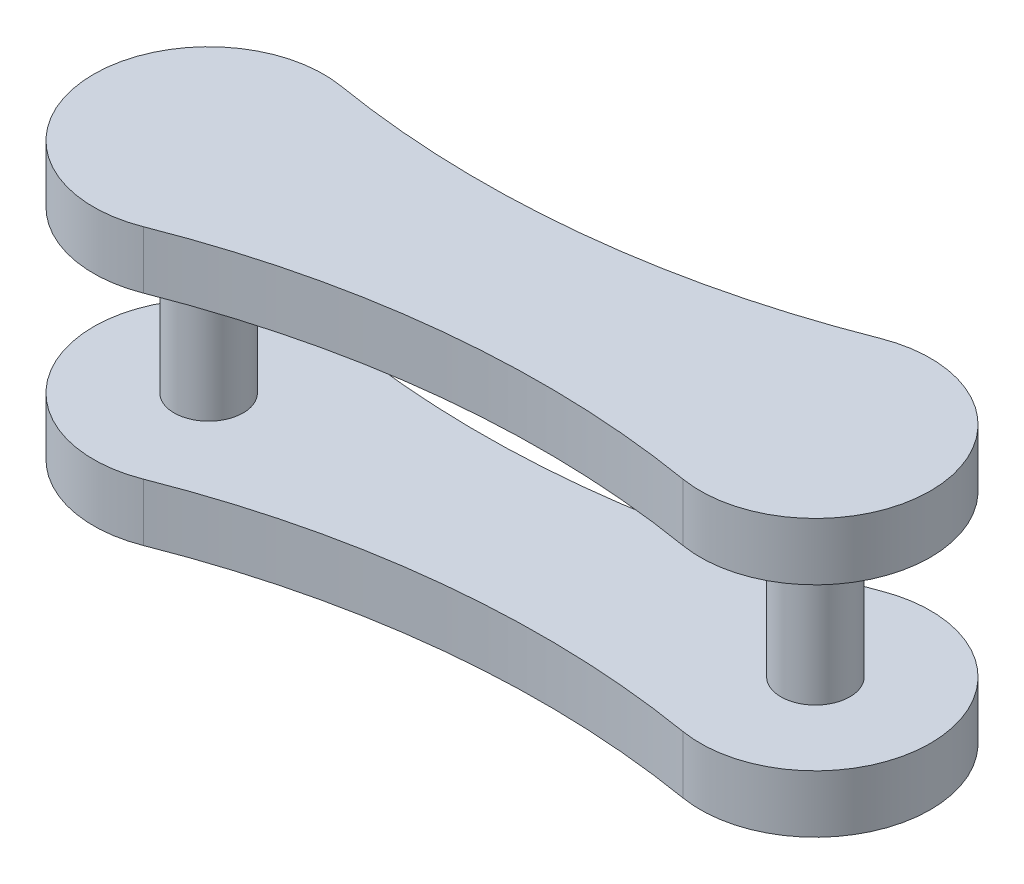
ISO-10303-21;
HEADER;
FILE_DESCRIPTION(('STEP AP214'),'2;1');
FILE_NAME('part.step','',(''),(''),'','','');
FILE_SCHEMA(('AUTOMOTIVE_DESIGN { 1 0 10303 214 1 1 1 1 }'));
ENDSEC;
DATA;
#1=APPLICATION_CONTEXT('core data for automotive mechanical design processes');
#2=APPLICATION_PROTOCOL_DEFINITION('international standard','automotive_design',2000,#1);
#3=PRODUCT_CONTEXT('',#1,'mechanical');
#4=PRODUCT('Part','Part','',(#3));
#5=PRODUCT_RELATED_PRODUCT_CATEGORY('part','',(#4));
#6=PRODUCT_DEFINITION_FORMATION('','',#4);
#7=PRODUCT_DEFINITION_CONTEXT('part definition',#1,'design');
#8=PRODUCT_DEFINITION('design','',#6,#7);
#9=PRODUCT_DEFINITION_SHAPE('','',#8);
#10=(LENGTH_UNIT() NAMED_UNIT(*) SI_UNIT(.MILLI.,.METRE.));
#11=(NAMED_UNIT(*) PLANE_ANGLE_UNIT() SI_UNIT($,.RADIAN.));
#12=(NAMED_UNIT(*) SI_UNIT($,.STERADIAN.) SOLID_ANGLE_UNIT());
#13=UNCERTAINTY_MEASURE_WITH_UNIT(LENGTH_MEASURE(1.E-05),#10,'distance_accuracy_value','');
#14=(GEOMETRIC_REPRESENTATION_CONTEXT(3) GLOBAL_UNCERTAINTY_ASSIGNED_CONTEXT((#13)) GLOBAL_UNIT_ASSIGNED_CONTEXT((#10,
#11,#12)) REPRESENTATION_CONTEXT('',''));
#15=CARTESIAN_POINT('',(0.,0.,0.));
#16=DIRECTION('',(0.,0.,1.));
#17=DIRECTION('',(1.,0.,0.));
#18=AXIS2_PLACEMENT_3D('',#15,#16,#17);
#19=CARTESIAN_POINT('',(0.,6.,0.));
#20=DIRECTION('',(0.,-1.,0.));
#21=DIRECTION('',(0.,0.,-1.));
#22=AXIS2_PLACEMENT_3D('',#19,#20,#21);
#23=PLANE('',#22);
#24=CARTESIAN_POINT('',(0.,6.,0.));
#25=DIRECTION('',(0.,-1.,0.));
#26=DIRECTION('',(0.994559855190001,0.,-0.104166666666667));
#27=AXIS2_PLACEMENT_3D('',#24,#25,#26);
#28=CIRCLE('',#27,5.);
#29=CARTESIAN_POINT('',(1.8280531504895,6.,4.65383945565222));
#30=VERTEX_POINT('',#29);
#31=CARTESIAN_POINT('',(0.824106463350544,6.,-4.93161723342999));
#32=VERTEX_POINT('',#31);
#33=EDGE_CURVE('E102',#30,#32,#28,.T.);
#34=ORIENTED_EDGE('',*,*,#33,.F.);
#35=CARTESIAN_POINT('',(16.4524783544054,6.,41.8845551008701));
#36=DIRECTION('',(0.,-1.,0.));
#37=DIRECTION('',(0.994559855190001,0.,-0.104166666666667));
#38=AXIS2_PLACEMENT_3D('',#35,#36,#37);
#39=CIRCLE('',#38,40.);
#40=CARTESIAN_POINT('',(23.0453300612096,6.,2.43161723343));
#41=VERTEX_POINT('',#40);
#42=EDGE_CURVE('E173',#30,#41,#39,.T.);
#43=ORIENTED_EDGE('',*,*,#42,.T.);
#44=CARTESIAN_POINT('',(23.86943652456,6.,-2.5));
#45=DIRECTION('',(0.,-1.,0.));
#46=DIRECTION('',(-0.994559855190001,0.,0.104166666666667));
#47=AXIS2_PLACEMENT_3D('',#44,#45,#46);
#48=CIRCLE('',#47,5.);
#49=CARTESIAN_POINT('',(22.0413833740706,6.,-7.15383945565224));
#50=VERTEX_POINT('',#49);
#51=EDGE_CURVE('E33',#50,#41,#48,.T.);
#52=ORIENTED_EDGE('',*,*,#51,.F.);
#53=CARTESIAN_POINT('',(7.4169581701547,6.,-44.3845551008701));
#54=DIRECTION('',(0.,-1.,0.));
#55=DIRECTION('',(-0.994559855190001,0.,0.104166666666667));
#56=AXIS2_PLACEMENT_3D('',#53,#54,#55);
#57=CIRCLE('',#56,40.);
#58=EDGE_CURVE('E110',#50,#32,#57,.T.);
#59=ORIENTED_EDGE('',*,*,#58,.T.);
#60=EDGE_LOOP('',(#34,#43,#52,#59));
#61=FACE_BOUND('',#60,.T.);
#62=ADVANCED_FACE('F14',(#61),#23,.F.);
#63=CARTESIAN_POINT('',(0.,-6.,0.));
#64=DIRECTION('',(0.,-1.,0.));
#65=DIRECTION('',(0.,0.,-1.));
#66=AXIS2_PLACEMENT_3D('',#63,#64,#65);
#67=PLANE('',#66);
#68=CARTESIAN_POINT('',(16.4524783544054,-6.,41.8845551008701));
#69=DIRECTION('',(0.,-1.,0.));
#70=DIRECTION('',(0.994559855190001,0.,-0.104166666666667));
#71=AXIS2_PLACEMENT_3D('',#68,#69,#70);
#72=CIRCLE('',#71,40.);
#73=CARTESIAN_POINT('',(1.8280531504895,-6.,4.65383945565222));
#74=VERTEX_POINT('',#73);
#75=CARTESIAN_POINT('',(23.0453300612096,-6.,2.43161723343));
#76=VERTEX_POINT('',#75);
#77=EDGE_CURVE('E129',#74,#76,#72,.T.);
#78=ORIENTED_EDGE('',*,*,#77,.F.);
#79=CARTESIAN_POINT('',(0.,-6.,0.));
#80=DIRECTION('',(0.,-1.,0.));
#81=DIRECTION('',(0.994559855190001,0.,-0.104166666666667));
#82=AXIS2_PLACEMENT_3D('',#79,#80,#81);
#83=CIRCLE('',#82,5.);
#84=CARTESIAN_POINT('',(0.824106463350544,-6.,-4.93161723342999));
#85=VERTEX_POINT('',#84);
#86=EDGE_CURVE('E150',#74,#85,#83,.T.);
#87=ORIENTED_EDGE('',*,*,#86,.T.);
#88=CARTESIAN_POINT('',(7.4169581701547,-6.,-44.3845551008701));
#89=DIRECTION('',(0.,-1.,0.));
#90=DIRECTION('',(-0.994559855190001,0.,0.104166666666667));
#91=AXIS2_PLACEMENT_3D('',#88,#89,#90);
#92=CIRCLE('',#91,40.);
#93=CARTESIAN_POINT('',(22.0413833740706,-6.,-7.15383945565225));
#94=VERTEX_POINT('',#93);
#95=EDGE_CURVE('E134',#94,#85,#92,.T.);
#96=ORIENTED_EDGE('',*,*,#95,.F.);
#97=CARTESIAN_POINT('',(23.86943652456,-6.,-2.5));
#98=DIRECTION('',(0.,-1.,0.));
#99=DIRECTION('',(-0.994559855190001,0.,0.104166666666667));
#100=AXIS2_PLACEMENT_3D('',#97,#98,#99);
#101=CIRCLE('',#100,5.);
#102=EDGE_CURVE('E152',#94,#76,#101,.T.);
#103=ORIENTED_EDGE('',*,*,#102,.T.);
#104=EDGE_LOOP('',(#78,#87,#96,#103));
#105=FACE_BOUND('',#104,.T.);
#106=ADVANCED_FACE('F217',(#105),#67,.T.);
#107=CARTESIAN_POINT('',(0.,-6.,0.));
#108=DIRECTION('',(0.,1.,0.));
#109=DIRECTION('',(0.,0.,1.));
#110=AXIS2_PLACEMENT_3D('',#107,#108,#109);
#111=CYLINDRICAL_SURFACE('',#110,1.5);
#112=CARTESIAN_POINT('',(0.,3.5,0.));
#113=DIRECTION('',(0.,-1.,0.));
#114=DIRECTION('',(1.,0.,0.));
#115=AXIS2_PLACEMENT_3D('',#112,#113,#114);
#116=CIRCLE('',#115,1.5);
#117=CARTESIAN_POINT('',(1.5,3.5,0.));
#118=VERTEX_POINT('',#117);
#119=EDGE_CURVE('E9',#118,#118,#116,.T.);
#120=ORIENTED_EDGE('',*,*,#119,.T.);
#121=EDGE_LOOP('',(#120));
#122=FACE_BOUND('',#121,.T.);
#123=CARTESIAN_POINT('',(0.,-3.5,0.));
#124=DIRECTION('',(0.,-1.,0.));
#125=DIRECTION('',(1.,0.,0.));
#126=AXIS2_PLACEMENT_3D('',#123,#124,#125);
#127=CIRCLE('',#126,1.5);
#128=CARTESIAN_POINT('',(1.5,-3.5,0.));
#129=VERTEX_POINT('',#128);
#130=EDGE_CURVE('E24',#129,#129,#127,.T.);
#131=ORIENTED_EDGE('',*,*,#130,.F.);
#132=EDGE_LOOP('',(#131));
#133=FACE_BOUND('',#132,.T.);
#134=ADVANCED_FACE('F210',(#122,#133),#111,.T.);
#135=CARTESIAN_POINT('',(23.86943652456,-6.,-2.49999999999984));
#136=DIRECTION('',(0.,1.,0.));
#137=DIRECTION('',(0.445861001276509,0.,-0.895102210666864));
#138=AXIS2_PLACEMENT_3D('',#135,#136,#137);
#139=CYLINDRICAL_SURFACE('',#138,1.5);
#140=CARTESIAN_POINT('',(23.86943652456,3.5,-2.5));
#141=DIRECTION('',(0.,-1.,0.));
#142=DIRECTION('',(0.994559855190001,0.,-0.104166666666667));
#143=AXIS2_PLACEMENT_3D('',#140,#141,#142);
#144=CIRCLE('',#143,1.5);
#145=CARTESIAN_POINT('',(25.3612763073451,3.5,-2.65625));
#146=VERTEX_POINT('',#145);
#147=EDGE_CURVE('E119',#146,#146,#144,.T.);
#148=ORIENTED_EDGE('',*,*,#147,.T.);
#149=EDGE_LOOP('',(#148));
#150=FACE_BOUND('',#149,.T.);
#151=CARTESIAN_POINT('',(23.86943652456,-3.5,-2.5));
#152=DIRECTION('',(0.,-1.,0.));
#153=DIRECTION('',(0.994559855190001,0.,-0.104166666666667));
#154=AXIS2_PLACEMENT_3D('',#151,#152,#153);
#155=CIRCLE('',#154,1.5);
#156=CARTESIAN_POINT('',(25.3612763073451,-3.5,-2.65625));
#157=VERTEX_POINT('',#156);
#158=EDGE_CURVE('E121',#157,#157,#155,.T.);
#159=ORIENTED_EDGE('',*,*,#158,.F.);
#160=EDGE_LOOP('',(#159));
#161=FACE_BOUND('',#160,.T.);
#162=ADVANCED_FACE('F195',(#150,#161),#139,.T.);
#163=CARTESIAN_POINT('',(23.86943652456,-6.,-2.5));
#164=DIRECTION('',(0.,1.,0.));
#165=DIRECTION('',(-0.994559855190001,0.,0.104166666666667));
#166=AXIS2_PLACEMENT_3D('',#163,#164,#165);
#167=CYLINDRICAL_SURFACE('',#166,5.);
#168=CARTESIAN_POINT('',(23.86943652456,-3.5,-2.5));
#169=DIRECTION('',(0.,-1.,0.));
#170=DIRECTION('',(-0.994559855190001,0.,0.104166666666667));
#171=AXIS2_PLACEMENT_3D('',#168,#169,#170);
#172=CIRCLE('',#171,5.);
#173=CARTESIAN_POINT('',(22.0413833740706,-3.5,-7.15383945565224));
#174=VERTEX_POINT('',#173);
#175=CARTESIAN_POINT('',(23.0453300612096,-3.5,2.43161723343));
#176=VERTEX_POINT('',#175);
#177=EDGE_CURVE('E18',#174,#176,#172,.T.);
#178=ORIENTED_EDGE('',*,*,#177,.T.);
#179=DIRECTION('',(0.,-1.,0.));
#180=VECTOR('',#179,1.);
#181=CARTESIAN_POINT('',(23.0453300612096,-3.5,2.43161723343));
#182=LINE('',#181,#180);
#183=EDGE_CURVE('E132',#176,#76,#182,.T.);
#184=ORIENTED_EDGE('',*,*,#183,.T.);
#185=ORIENTED_EDGE('',*,*,#102,.F.);
#186=DIRECTION('',(0.,-1.,0.));
#187=VECTOR('',#186,1.);
#188=CARTESIAN_POINT('',(22.0413833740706,-3.5,-7.15383945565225));
#189=LINE('',#188,#187);
#190=EDGE_CURVE('E139',#174,#94,#189,.T.);
#191=ORIENTED_EDGE('',*,*,#190,.F.);
#192=EDGE_LOOP('',(#178,#184,#185,#191));
#193=FACE_BOUND('',#192,.T.);
#194=ADVANCED_FACE('F165',(#193),#167,.T.);
#195=CARTESIAN_POINT('',(7.4169581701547,-3.5,-44.3845551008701));
#196=DIRECTION('',(0.,-1.,0.));
#197=DIRECTION('',(0.994559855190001,0.,-0.104166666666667));
#198=AXIS2_PLACEMENT_3D('',#195,#196,#197);
#199=CYLINDRICAL_SURFACE('',#198,40.);
#200=ORIENTED_EDGE('',*,*,#95,.T.);
#201=DIRECTION('',(0.,-1.,0.));
#202=VECTOR('',#201,1.);
#203=CARTESIAN_POINT('',(0.824106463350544,-3.5,-4.93161723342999));
#204=LINE('',#203,#202);
#205=CARTESIAN_POINT('',(0.824106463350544,-3.5,-4.93161723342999));
#206=VERTEX_POINT('',#205);
#207=EDGE_CURVE('E142',#206,#85,#204,.T.);
#208=ORIENTED_EDGE('',*,*,#207,.F.);
#209=CARTESIAN_POINT('',(7.4169581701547,-3.5,-44.3845551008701));
#210=DIRECTION('',(0.,-1.,0.));
#211=DIRECTION('',(-0.994559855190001,0.,0.104166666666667));
#212=AXIS2_PLACEMENT_3D('',#209,#210,#211);
#213=CIRCLE('',#212,40.);
#214=EDGE_CURVE('E137',#174,#206,#213,.T.);
#215=ORIENTED_EDGE('',*,*,#214,.F.);
#216=ORIENTED_EDGE('',*,*,#190,.T.);
#217=EDGE_LOOP('',(#200,#208,#215,#216));
#218=FACE_BOUND('',#217,.T.);
#219=ADVANCED_FACE('F158',(#218),#199,.F.);
#220=CARTESIAN_POINT('',(0.,-6.,0.));
#221=DIRECTION('',(0.,1.,0.));
#222=DIRECTION('',(-0.994559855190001,0.,0.104166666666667));
#223=AXIS2_PLACEMENT_3D('',#220,#221,#222);
#224=CYLINDRICAL_SURFACE('',#223,5.);
#225=CARTESIAN_POINT('',(0.,-3.5,0.));
#226=DIRECTION('',(0.,-1.,0.));
#227=DIRECTION('',(0.994559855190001,0.,-0.104166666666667));
#228=AXIS2_PLACEMENT_3D('',#225,#226,#227);
#229=CIRCLE('',#228,5.);
#230=CARTESIAN_POINT('',(1.8280531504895,-3.5,4.65383945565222));
#231=VERTEX_POINT('',#230);
#232=EDGE_CURVE('E145',#231,#206,#229,.T.);
#233=ORIENTED_EDGE('',*,*,#232,.T.);
#234=ORIENTED_EDGE('',*,*,#207,.T.);
#235=ORIENTED_EDGE('',*,*,#86,.F.);
#236=DIRECTION('',(0.,-1.,0.));
#237=VECTOR('',#236,1.);
#238=CARTESIAN_POINT('',(1.8280531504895,-3.5,4.65383945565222));
#239=LINE('',#238,#237);
#240=EDGE_CURVE('E128',#231,#74,#239,.T.);
#241=ORIENTED_EDGE('',*,*,#240,.F.);
#242=EDGE_LOOP('',(#233,#234,#235,#241));
#243=FACE_BOUND('',#242,.T.);
#244=ADVANCED_FACE('F16',(#243),#224,.T.);
#245=CARTESIAN_POINT('',(16.4524783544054,-3.5,41.8845551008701));
#246=DIRECTION('',(0.,-1.,0.));
#247=DIRECTION('',(0.994559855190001,0.,-0.104166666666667));
#248=AXIS2_PLACEMENT_3D('',#245,#246,#247);
#249=CYLINDRICAL_SURFACE('',#248,40.);
#250=ORIENTED_EDGE('',*,*,#77,.T.);
#251=ORIENTED_EDGE('',*,*,#183,.F.);
#252=CARTESIAN_POINT('',(16.4524783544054,-3.5,41.8845551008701));
#253=DIRECTION('',(0.,-1.,0.));
#254=DIRECTION('',(0.994559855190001,0.,-0.104166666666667));
#255=AXIS2_PLACEMENT_3D('',#252,#253,#254);
#256=CIRCLE('',#255,40.);
#257=EDGE_CURVE('E126',#231,#176,#256,.T.);
#258=ORIENTED_EDGE('',*,*,#257,.F.);
#259=ORIENTED_EDGE('',*,*,#240,.T.);
#260=EDGE_LOOP('',(#250,#251,#258,#259));
#261=FACE_BOUND('',#260,.T.);
#262=ADVANCED_FACE('F163',(#261),#249,.F.);
#263=CARTESIAN_POINT('',(0.,-3.5,0.));
#264=DIRECTION('',(0.,-1.,0.));
#265=DIRECTION('',(0.994559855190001,0.,-0.104166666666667));
#266=AXIS2_PLACEMENT_3D('',#263,#264,#265);
#267=PLANE('',#266);
#268=ORIENTED_EDGE('',*,*,#232,.F.);
#269=ORIENTED_EDGE('',*,*,#257,.T.);
#270=ORIENTED_EDGE('',*,*,#177,.F.);
#271=ORIENTED_EDGE('',*,*,#214,.T.);
#272=EDGE_LOOP('',(#268,#269,#270,#271));
#273=FACE_BOUND('',#272,.T.);
#274=ORIENTED_EDGE('',*,*,#158,.T.);
#275=EDGE_LOOP('',(#274));
#276=FACE_BOUND('',#275,.T.);
#277=ORIENTED_EDGE('',*,*,#130,.T.);
#278=EDGE_LOOP('',(#277));
#279=FACE_BOUND('',#278,.T.);
#280=ADVANCED_FACE('F160',(#273,#276,#279),#267,.F.);
#281=CARTESIAN_POINT('',(7.4169581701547,6.,-44.3845551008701));
#282=DIRECTION('',(0.,-1.,0.));
#283=DIRECTION('',(0.994559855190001,0.,-0.104166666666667));
#284=AXIS2_PLACEMENT_3D('',#281,#282,#283);
#285=CYLINDRICAL_SURFACE('',#284,40.);
#286=CARTESIAN_POINT('',(7.4169581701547,3.5,-44.3845551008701));
#287=DIRECTION('',(0.,-1.,0.));
#288=DIRECTION('',(-0.994559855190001,0.,0.104166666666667));
#289=AXIS2_PLACEMENT_3D('',#286,#287,#288);
#290=CIRCLE('',#289,40.);
#291=CARTESIAN_POINT('',(22.0413833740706,3.5,-7.15383945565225));
#292=VERTEX_POINT('',#291);
#293=CARTESIAN_POINT('',(0.824106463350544,3.5,-4.93161723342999));
#294=VERTEX_POINT('',#293);
#295=EDGE_CURVE('E93',#292,#294,#290,.T.);
#296=ORIENTED_EDGE('',*,*,#295,.T.);
#297=DIRECTION('',(0.,-1.,0.));
#298=VECTOR('',#297,1.);
#299=CARTESIAN_POINT('',(0.824106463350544,6.,-4.93161723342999));
#300=LINE('',#299,#298);
#301=EDGE_CURVE('E99',#32,#294,#300,.T.);
#302=ORIENTED_EDGE('',*,*,#301,.F.);
#303=ORIENTED_EDGE('',*,*,#58,.F.);
#304=DIRECTION('',(0.,-1.,0.));
#305=VECTOR('',#304,1.);
#306=CARTESIAN_POINT('',(22.0413833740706,6.,-7.15383945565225));
#307=LINE('',#306,#305);
#308=EDGE_CURVE('E106',#50,#292,#307,.T.);
#309=ORIENTED_EDGE('',*,*,#308,.T.);
#310=EDGE_LOOP('',(#296,#302,#303,#309));
#311=FACE_BOUND('',#310,.T.);
#312=ADVANCED_FACE('F109',(#311),#285,.F.);
#313=CARTESIAN_POINT('',(23.86943652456,3.5,-2.5));
#314=DIRECTION('',(0.,1.,0.));
#315=DIRECTION('',(-0.994559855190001,0.,0.104166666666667));
#316=AXIS2_PLACEMENT_3D('',#313,#314,#315);
#317=CYLINDRICAL_SURFACE('',#316,5.);
#318=ORIENTED_EDGE('',*,*,#51,.T.);
#319=DIRECTION('',(0.,-1.,0.));
#320=VECTOR('',#319,1.);
#321=CARTESIAN_POINT('',(23.0453300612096,6.,2.43161723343));
#322=LINE('',#321,#320);
#323=CARTESIAN_POINT('',(23.0453300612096,3.5,2.43161723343));
#324=VERTEX_POINT('',#323);
#325=EDGE_CURVE('E111',#41,#324,#322,.T.);
#326=ORIENTED_EDGE('',*,*,#325,.T.);
#327=CARTESIAN_POINT('',(23.86943652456,3.5,-2.5));
#328=DIRECTION('',(0.,-1.,0.));
#329=DIRECTION('',(-0.994559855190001,0.,0.104166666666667));
#330=AXIS2_PLACEMENT_3D('',#327,#328,#329);
#331=CIRCLE('',#330,5.);
#332=EDGE_CURVE('E96',#292,#324,#331,.T.);
#333=ORIENTED_EDGE('',*,*,#332,.F.);
#334=ORIENTED_EDGE('',*,*,#308,.F.);
#335=EDGE_LOOP('',(#318,#326,#333,#334));
#336=FACE_BOUND('',#335,.T.);
#337=ADVANCED_FACE('F180',(#336),#317,.T.);
#338=CARTESIAN_POINT('',(16.4524783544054,6.,41.8845551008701));
#339=DIRECTION('',(0.,-1.,0.));
#340=DIRECTION('',(0.994559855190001,0.,-0.104166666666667));
#341=AXIS2_PLACEMENT_3D('',#338,#339,#340);
#342=CYLINDRICAL_SURFACE('',#341,40.);
#343=CARTESIAN_POINT('',(16.4524783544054,3.5,41.8845551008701));
#344=DIRECTION('',(0.,-1.,0.));
#345=DIRECTION('',(0.994559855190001,0.,-0.104166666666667));
#346=AXIS2_PLACEMENT_3D('',#343,#344,#345);
#347=CIRCLE('',#346,40.);
#348=CARTESIAN_POINT('',(1.8280531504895,3.5,4.65383945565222));
#349=VERTEX_POINT('',#348);
#350=EDGE_CURVE('E95',#349,#324,#347,.T.);
#351=ORIENTED_EDGE('',*,*,#350,.T.);
#352=ORIENTED_EDGE('',*,*,#325,.F.);
#353=ORIENTED_EDGE('',*,*,#42,.F.);
#354=DIRECTION('',(0.,-1.,0.));
#355=VECTOR('',#354,1.);
#356=CARTESIAN_POINT('',(1.8280531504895,6.,4.65383945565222));
#357=LINE('',#356,#355);
#358=EDGE_CURVE('E114',#30,#349,#357,.T.);
#359=ORIENTED_EDGE('',*,*,#358,.T.);
#360=EDGE_LOOP('',(#351,#352,#353,#359));
#361=FACE_BOUND('',#360,.T.);
#362=ADVANCED_FACE('F178',(#361),#342,.F.);
#363=CARTESIAN_POINT('',(0.,3.5,0.));
#364=DIRECTION('',(0.,1.,0.));
#365=DIRECTION('',(-0.994559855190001,0.,0.104166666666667));
#366=AXIS2_PLACEMENT_3D('',#363,#364,#365);
#367=CYLINDRICAL_SURFACE('',#366,5.);
#368=ORIENTED_EDGE('',*,*,#33,.T.);
#369=ORIENTED_EDGE('',*,*,#301,.T.);
#370=CARTESIAN_POINT('',(0.,3.5,0.));
#371=DIRECTION('',(0.,-1.,0.));
#372=DIRECTION('',(0.994559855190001,0.,-0.104166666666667));
#373=AXIS2_PLACEMENT_3D('',#370,#371,#372);
#374=CIRCLE('',#373,5.);
#375=EDGE_CURVE('E75',#349,#294,#374,.T.);
#376=ORIENTED_EDGE('',*,*,#375,.F.);
#377=ORIENTED_EDGE('',*,*,#358,.F.);
#378=EDGE_LOOP('',(#368,#369,#376,#377));
#379=FACE_BOUND('',#378,.T.);
#380=ADVANCED_FACE('F100',(#379),#367,.T.);
#381=CARTESIAN_POINT('',(0.,3.5,0.));
#382=DIRECTION('',(0.,-1.,0.));
#383=DIRECTION('',(0.994559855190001,0.,-0.104166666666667));
#384=AXIS2_PLACEMENT_3D('',#381,#382,#383);
#385=PLANE('',#384);
#386=ORIENTED_EDGE('',*,*,#350,.F.);
#387=ORIENTED_EDGE('',*,*,#375,.T.);
#388=ORIENTED_EDGE('',*,*,#295,.F.);
#389=ORIENTED_EDGE('',*,*,#332,.T.);
#390=EDGE_LOOP('',(#386,#387,#388,#389));
#391=FACE_BOUND('',#390,.T.);
#392=ORIENTED_EDGE('',*,*,#147,.F.);
#393=EDGE_LOOP('',(#392));
#394=FACE_BOUND('',#393,.T.);
#395=ORIENTED_EDGE('',*,*,#119,.F.);
#396=EDGE_LOOP('',(#395));
#397=FACE_BOUND('',#396,.T.);
#398=ADVANCED_FACE('F90',(#391,#394,#397),#385,.T.);
#399=CLOSED_SHELL('',(#62,#106,#134,#162,#194,#219,#244,#262,#280,#312,#337,#362,#380,#398));
#400=MANIFOLD_SOLID_BREP('B1',#399);
#401=ADVANCED_BREP_SHAPE_REPRESENTATION('',(#18,#400),#14);
#402=SHAPE_DEFINITION_REPRESENTATION(#9,#401);
ENDSEC;
END-ISO-10303-21;
